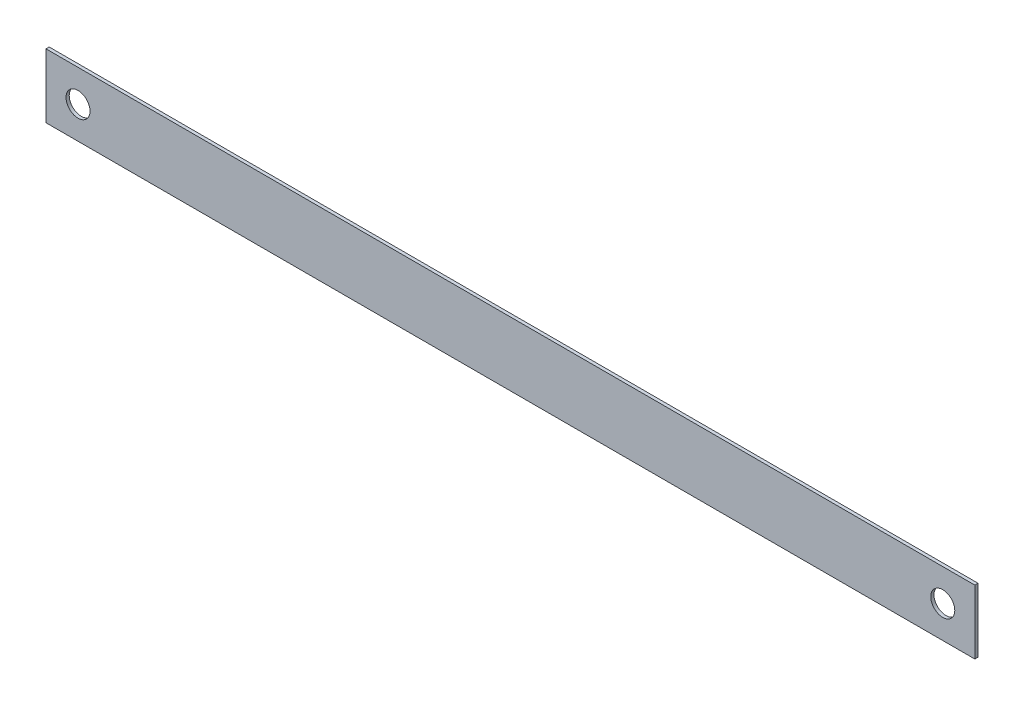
ISO-10303-21;
HEADER;
FILE_DESCRIPTION(('STEP AP214'),'2;1');
FILE_NAME('part.step','',(''),(''),'','','');
FILE_SCHEMA(('AUTOMOTIVE_DESIGN { 1 0 10303 214 1 1 1 1 }'));
ENDSEC;
DATA;
#1=APPLICATION_CONTEXT('core data for automotive mechanical design processes');
#2=APPLICATION_PROTOCOL_DEFINITION('international standard','automotive_design',2000,#1);
#3=PRODUCT_CONTEXT('',#1,'mechanical');
#4=PRODUCT('Part','Part','',(#3));
#5=PRODUCT_RELATED_PRODUCT_CATEGORY('part','',(#4));
#6=PRODUCT_DEFINITION_FORMATION('','',#4);
#7=PRODUCT_DEFINITION_CONTEXT('part definition',#1,'design');
#8=PRODUCT_DEFINITION('design','',#6,#7);
#9=PRODUCT_DEFINITION_SHAPE('','',#8);
#10=(LENGTH_UNIT() NAMED_UNIT(*) SI_UNIT(.MILLI.,.METRE.));
#11=(NAMED_UNIT(*) PLANE_ANGLE_UNIT() SI_UNIT($,.RADIAN.));
#12=(NAMED_UNIT(*) SI_UNIT($,.STERADIAN.) SOLID_ANGLE_UNIT());
#13=UNCERTAINTY_MEASURE_WITH_UNIT(LENGTH_MEASURE(1.E-05),#10,'distance_accuracy_value','');
#14=(GEOMETRIC_REPRESENTATION_CONTEXT(3) GLOBAL_UNCERTAINTY_ASSIGNED_CONTEXT((#13)) GLOBAL_UNIT_ASSIGNED_CONTEXT((#10,
#11,#12)) REPRESENTATION_CONTEXT('',''));
#15=CARTESIAN_POINT('',(0.,0.,0.));
#16=DIRECTION('',(0.,0.,1.));
#17=DIRECTION('',(1.,0.,0.));
#18=AXIS2_PLACEMENT_3D('',#15,#16,#17);
#19=CARTESIAN_POINT('',(-145.,10.,1.));
#20=DIRECTION('',(0.,0.,1.));
#21=DIRECTION('',(1.,0.,0.));
#22=AXIS2_PLACEMENT_3D('',#19,#20,#21);
#23=PLANE('',#22);
#24=DIRECTION('',(0.,-1.,0.));
#25=VECTOR('',#24,1.);
#26=CARTESIAN_POINT('',(-145.,10.,1.));
#27=LINE('',#26,#25);
#28=CARTESIAN_POINT('',(-145.,10.,1.));
#29=VERTEX_POINT('',#28);
#30=CARTESIAN_POINT('',(-145.,-9.99999999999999,1.));
#31=VERTEX_POINT('',#30);
#32=EDGE_CURVE('E95',#29,#31,#27,.T.);
#33=ORIENTED_EDGE('',*,*,#32,.T.);
#34=DIRECTION('',(-1.,0.,0.));
#35=VECTOR('',#34,1.);
#36=CARTESIAN_POINT('',(145.,-10.,1.));
#37=LINE('',#36,#35);
#38=CARTESIAN_POINT('',(145.,-10.,1.));
#39=VERTEX_POINT('',#38);
#40=EDGE_CURVE('E76',#39,#31,#37,.T.);
#41=ORIENTED_EDGE('',*,*,#40,.F.);
#42=DIRECTION('',(0.,1.,0.));
#43=VECTOR('',#42,1.);
#44=CARTESIAN_POINT('',(145.,-10.,1.));
#45=LINE('',#44,#43);
#46=CARTESIAN_POINT('',(145.,10.,1.));
#47=VERTEX_POINT('',#46);
#48=EDGE_CURVE('E98',#39,#47,#45,.T.);
#49=ORIENTED_EDGE('',*,*,#48,.T.);
#50=DIRECTION('',(1.,0.,0.));
#51=VECTOR('',#50,1.);
#52=CARTESIAN_POINT('',(-145.,10.,1.));
#53=LINE('',#52,#51);
#54=EDGE_CURVE('E100',#29,#47,#53,.T.);
#55=ORIENTED_EDGE('',*,*,#54,.F.);
#56=EDGE_LOOP('',(#33,#41,#49,#55));
#57=FACE_BOUND('',#56,.T.);
#58=CARTESIAN_POINT('',(135.,0.,1.));
#59=DIRECTION('',(0.,0.,1.));
#60=DIRECTION('',(1.,0.,0.));
#61=AXIS2_PLACEMENT_3D('',#58,#59,#60);
#62=CIRCLE('',#61,3.75000000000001);
#63=CARTESIAN_POINT('',(138.75,0.,1.));
#64=VERTEX_POINT('',#63);
#65=EDGE_CURVE('E183',#64,#64,#62,.T.);
#66=ORIENTED_EDGE('',*,*,#65,.F.);
#67=EDGE_LOOP('',(#66));
#68=FACE_BOUND('',#67,.T.);
#69=CARTESIAN_POINT('',(-135.,0.,1.));
#70=DIRECTION('',(0.,0.,-1.));
#71=DIRECTION('',(-1.,0.,0.));
#72=AXIS2_PLACEMENT_3D('',#69,#70,#71);
#73=CIRCLE('',#72,3.75000000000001);
#74=CARTESIAN_POINT('',(-138.75,0.,1.));
#75=VERTEX_POINT('',#74);
#76=EDGE_CURVE('E180',#75,#75,#73,.T.);
#77=ORIENTED_EDGE('',*,*,#76,.T.);
#78=EDGE_LOOP('',(#77));
#79=FACE_BOUND('',#78,.T.);
#80=ADVANCED_FACE('F29',(#57,#68,#79),#23,.T.);
#81=CARTESIAN_POINT('',(-145.,10.,0.));
#82=DIRECTION('',(0.,0.,1.));
#83=DIRECTION('',(1.,0.,0.));
#84=AXIS2_PLACEMENT_3D('',#81,#82,#83);
#85=PLANE('',#84);
#86=DIRECTION('',(0.,-1.,0.));
#87=VECTOR('',#86,1.);
#88=CARTESIAN_POINT('',(-145.,10.,0.));
#89=LINE('',#88,#87);
#90=CARTESIAN_POINT('',(-145.,10.,0.));
#91=VERTEX_POINT('',#90);
#92=CARTESIAN_POINT('',(-145.,-9.99999999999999,0.));
#93=VERTEX_POINT('',#92);
#94=EDGE_CURVE('E80',#91,#93,#89,.T.);
#95=ORIENTED_EDGE('',*,*,#94,.F.);
#96=DIRECTION('',(1.,0.,0.));
#97=VECTOR('',#96,1.);
#98=CARTESIAN_POINT('',(-145.,10.,0.));
#99=LINE('',#98,#97);
#100=CARTESIAN_POINT('',(145.,10.,0.));
#101=VERTEX_POINT('',#100);
#102=EDGE_CURVE('E90',#91,#101,#99,.T.);
#103=ORIENTED_EDGE('',*,*,#102,.T.);
#104=DIRECTION('',(0.,1.,0.));
#105=VECTOR('',#104,1.);
#106=CARTESIAN_POINT('',(145.,-10.,0.));
#107=LINE('',#106,#105);
#108=CARTESIAN_POINT('',(145.,-10.,0.));
#109=VERTEX_POINT('',#108);
#110=EDGE_CURVE('E88',#109,#101,#107,.T.);
#111=ORIENTED_EDGE('',*,*,#110,.F.);
#112=DIRECTION('',(-1.,0.,0.));
#113=VECTOR('',#112,1.);
#114=CARTESIAN_POINT('',(145.,-10.,0.));
#115=LINE('',#114,#113);
#116=EDGE_CURVE('E73',#109,#93,#115,.T.);
#117=ORIENTED_EDGE('',*,*,#116,.T.);
#118=EDGE_LOOP('',(#95,#103,#111,#117));
#119=FACE_BOUND('',#118,.T.);
#120=CARTESIAN_POINT('',(135.,0.,0.));
#121=DIRECTION('',(0.,0.,1.));
#122=DIRECTION('',(1.,0.,0.));
#123=AXIS2_PLACEMENT_3D('',#120,#121,#122);
#124=CIRCLE('',#123,3.75000000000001);
#125=CARTESIAN_POINT('',(138.75,0.,0.));
#126=VERTEX_POINT('',#125);
#127=EDGE_CURVE('E84',#126,#126,#124,.T.);
#128=ORIENTED_EDGE('',*,*,#127,.T.);
#129=EDGE_LOOP('',(#128));
#130=FACE_BOUND('',#129,.T.);
#131=CARTESIAN_POINT('',(-135.,0.,0.));
#132=DIRECTION('',(0.,0.,-1.));
#133=DIRECTION('',(-1.,0.,0.));
#134=AXIS2_PLACEMENT_3D('',#131,#132,#133);
#135=CIRCLE('',#134,3.75000000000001);
#136=CARTESIAN_POINT('',(-138.75,0.,0.));
#137=VERTEX_POINT('',#136);
#138=EDGE_CURVE('E177',#137,#137,#135,.T.);
#139=ORIENTED_EDGE('',*,*,#138,.F.);
#140=EDGE_LOOP('',(#139));
#141=FACE_BOUND('',#140,.T.);
#142=ADVANCED_FACE('F86',(#119,#130,#141),#85,.F.);
#143=CARTESIAN_POINT('',(-145.,10.,1.));
#144=DIRECTION('',(1.,0.,0.));
#145=DIRECTION('',(0.,0.,-1.));
#146=AXIS2_PLACEMENT_3D('',#143,#144,#145);
#147=PLANE('',#146);
#148=DIRECTION('',(0.,0.,-1.));
#149=VECTOR('',#148,1.);
#150=CARTESIAN_POINT('',(-145.,-9.99999999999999,1.));
#151=LINE('',#150,#149);
#152=EDGE_CURVE('E11',#31,#93,#151,.T.);
#153=ORIENTED_EDGE('',*,*,#152,.F.);
#154=ORIENTED_EDGE('',*,*,#32,.F.);
#155=DIRECTION('',(0.,0.,-1.));
#156=VECTOR('',#155,1.);
#157=CARTESIAN_POINT('',(-145.,10.,1.));
#158=LINE('',#157,#156);
#159=EDGE_CURVE('E44',#29,#91,#158,.T.);
#160=ORIENTED_EDGE('',*,*,#159,.T.);
#161=ORIENTED_EDGE('',*,*,#94,.T.);
#162=EDGE_LOOP('',(#153,#154,#160,#161));
#163=FACE_BOUND('',#162,.T.);
#164=ADVANCED_FACE('F81',(#163),#147,.F.);
#165=CARTESIAN_POINT('',(145.,-10.,1.));
#166=DIRECTION('',(0.,-1.,0.));
#167=DIRECTION('',(1.,0.,0.));
#168=AXIS2_PLACEMENT_3D('',#165,#166,#167);
#169=PLANE('',#168);
#170=DIRECTION('',(0.,0.,-1.));
#171=VECTOR('',#170,1.);
#172=CARTESIAN_POINT('',(145.,-10.,1.));
#173=LINE('',#172,#171);
#174=EDGE_CURVE('E37',#39,#109,#173,.T.);
#175=ORIENTED_EDGE('',*,*,#174,.F.);
#176=ORIENTED_EDGE('',*,*,#40,.T.);
#177=ORIENTED_EDGE('',*,*,#152,.T.);
#178=ORIENTED_EDGE('',*,*,#116,.F.);
#179=EDGE_LOOP('',(#175,#176,#177,#178));
#180=FACE_BOUND('',#179,.T.);
#181=ADVANCED_FACE('F31',(#180),#169,.T.);
#182=CARTESIAN_POINT('',(145.,-10.,1.));
#183=DIRECTION('',(-1.,0.,0.));
#184=DIRECTION('',(0.,0.,1.));
#185=AXIS2_PLACEMENT_3D('',#182,#183,#184);
#186=PLANE('',#185);
#187=DIRECTION('',(0.,0.,-1.));
#188=VECTOR('',#187,1.);
#189=CARTESIAN_POINT('',(145.,10.,1.));
#190=LINE('',#189,#188);
#191=EDGE_CURVE('E52',#47,#101,#190,.T.);
#192=ORIENTED_EDGE('',*,*,#191,.F.);
#193=ORIENTED_EDGE('',*,*,#48,.F.);
#194=ORIENTED_EDGE('',*,*,#174,.T.);
#195=ORIENTED_EDGE('',*,*,#110,.T.);
#196=EDGE_LOOP('',(#192,#193,#194,#195));
#197=FACE_BOUND('',#196,.T.);
#198=ADVANCED_FACE('F103',(#197),#186,.F.);
#199=CARTESIAN_POINT('',(-145.,10.,1.));
#200=DIRECTION('',(0.,1.,0.));
#201=DIRECTION('',(0.,0.,1.));
#202=AXIS2_PLACEMENT_3D('',#199,#200,#201);
#203=PLANE('',#202);
#204=ORIENTED_EDGE('',*,*,#54,.T.);
#205=ORIENTED_EDGE('',*,*,#191,.T.);
#206=ORIENTED_EDGE('',*,*,#102,.F.);
#207=ORIENTED_EDGE('',*,*,#159,.F.);
#208=EDGE_LOOP('',(#204,#205,#206,#207));
#209=FACE_BOUND('',#208,.T.);
#210=ADVANCED_FACE('F107',(#209),#203,.T.);
#211=CARTESIAN_POINT('',(135.,0.,0.));
#212=DIRECTION('',(0.,0.,1.));
#213=DIRECTION('',(1.,0.,0.));
#214=AXIS2_PLACEMENT_3D('',#211,#212,#213);
#215=CYLINDRICAL_SURFACE('',#214,3.75000000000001);
#216=ORIENTED_EDGE('',*,*,#127,.F.);
#217=EDGE_LOOP('',(#216));
#218=FACE_BOUND('',#217,.T.);
#219=ORIENTED_EDGE('',*,*,#65,.T.);
#220=EDGE_LOOP('',(#219));
#221=FACE_BOUND('',#220,.T.);
#222=ADVANCED_FACE('F109',(#218,#221),#215,.F.);
#223=CARTESIAN_POINT('',(-135.,0.,0.));
#224=DIRECTION('',(0.,0.,1.));
#225=DIRECTION('',(1.,0.,0.));
#226=AXIS2_PLACEMENT_3D('',#223,#224,#225);
#227=CYLINDRICAL_SURFACE('',#226,3.75000000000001);
#228=ORIENTED_EDGE('',*,*,#138,.T.);
#229=EDGE_LOOP('',(#228));
#230=FACE_BOUND('',#229,.T.);
#231=ORIENTED_EDGE('',*,*,#76,.F.);
#232=EDGE_LOOP('',(#231));
#233=FACE_BOUND('',#232,.T.);
#234=ADVANCED_FACE('F115',(#230,#233),#227,.F.);
#235=CLOSED_SHELL('',(#80,#142,#164,#181,#198,#210,#222,#234));
#236=MANIFOLD_SOLID_BREP('B2',#235);
#237=ADVANCED_BREP_SHAPE_REPRESENTATION('',(#18,#236),#14);
#238=SHAPE_DEFINITION_REPRESENTATION(#9,#237);
ENDSEC;
END-ISO-10303-21;
